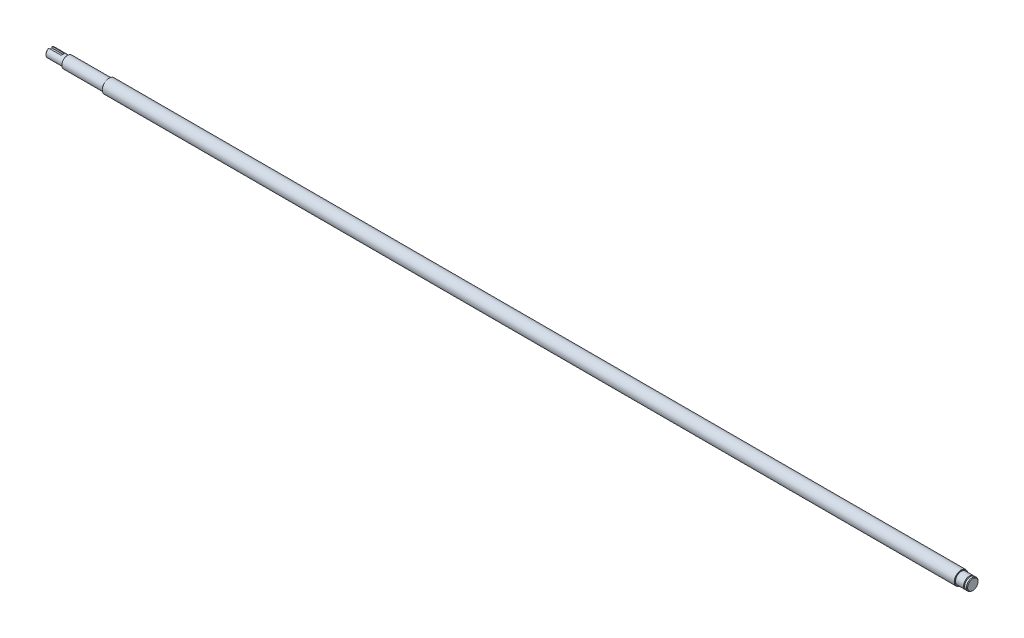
ISO-10303-21;
HEADER;
FILE_DESCRIPTION(('STEP AP214'),'2;1');
FILE_NAME('part.step','',(''),(''),'','','');
FILE_SCHEMA(('AUTOMOTIVE_DESIGN { 1 0 10303 214 1 1 1 1 }'));
ENDSEC;
DATA;
#1=APPLICATION_CONTEXT('core data for automotive mechanical design processes');
#2=APPLICATION_PROTOCOL_DEFINITION('international standard','automotive_design',2000,#1);
#3=PRODUCT_CONTEXT('',#1,'mechanical');
#4=PRODUCT('Part','Part','',(#3));
#5=PRODUCT_RELATED_PRODUCT_CATEGORY('part','',(#4));
#6=PRODUCT_DEFINITION_FORMATION('','',#4);
#7=PRODUCT_DEFINITION_CONTEXT('part definition',#1,'design');
#8=PRODUCT_DEFINITION('design','',#6,#7);
#9=PRODUCT_DEFINITION_SHAPE('','',#8);
#10=(LENGTH_UNIT() NAMED_UNIT(*) SI_UNIT(.MILLI.,.METRE.));
#11=(NAMED_UNIT(*) PLANE_ANGLE_UNIT() SI_UNIT($,.RADIAN.));
#12=(NAMED_UNIT(*) SI_UNIT($,.STERADIAN.) SOLID_ANGLE_UNIT());
#13=UNCERTAINTY_MEASURE_WITH_UNIT(LENGTH_MEASURE(1.E-05),#10,'distance_accuracy_value','');
#14=(GEOMETRIC_REPRESENTATION_CONTEXT(3) GLOBAL_UNCERTAINTY_ASSIGNED_CONTEXT((#13)) GLOBAL_UNIT_ASSIGNED_CONTEXT((#10,
#11,#12)) REPRESENTATION_CONTEXT('',''));
#15=CARTESIAN_POINT('',(0.,0.,0.));
#16=DIRECTION('',(0.,0.,1.));
#17=DIRECTION('',(1.,0.,0.));
#18=AXIS2_PLACEMENT_3D('',#15,#16,#17);
#19=CARTESIAN_POINT('',(0.,0.,0.));
#20=DIRECTION('',(1.,0.,0.));
#21=DIRECTION('',(0.,0.,-1.));
#22=AXIS2_PLACEMENT_3D('',#19,#20,#21);
#23=PLANE('',#22);
#24=DIRECTION('',(0.,0.,-1.));
#25=VECTOR('',#24,1.);
#26=CARTESIAN_POINT('',(1.70530256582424E-10,2.2,291593.51));
#27=LINE('',#26,#25);
#28=CARTESIAN_POINT('',(1.9197548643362E-12,2.2,1.50000000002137));
#29=VERTEX_POINT('',#28);
#30=CARTESIAN_POINT('',(1.9180201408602E-12,2.2,-1.50000000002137));
#31=VERTEX_POINT('',#30);
#32=EDGE_CURVE('E111',#29,#31,#27,.T.);
#33=ORIENTED_EDGE('',*,*,#32,.T.);
#34=DIRECTION('',(0.,-1.,0.));
#35=VECTOR('',#34,1.);
#36=CARTESIAN_POINT('',(1.9180201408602E-12,6.2,-1.50000000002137));
#37=LINE('',#36,#35);
#38=CARTESIAN_POINT('',(1.91802014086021E-12,3.16227766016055,-1.50000000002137));
#39=VERTEX_POINT('',#38);
#40=EDGE_CURVE('E123',#39,#31,#37,.T.);
#41=ORIENTED_EDGE('',*,*,#40,.F.);
#42=CARTESIAN_POINT('',(0.,0.,0.));
#43=DIRECTION('',(1.,0.,0.));
#44=DIRECTION('',(0.,0.,-1.));
#45=AXIS2_PLACEMENT_3D('',#42,#43,#44);
#46=CIRCLE('',#45,3.50000000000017);
#47=CARTESIAN_POINT('',(0.,3.16227766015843,1.50000000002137));
#48=VERTEX_POINT('',#47);
#49=EDGE_CURVE('E156',#39,#48,#46,.F.);
#50=ORIENTED_EDGE('',*,*,#49,.T.);
#51=DIRECTION('',(0.,-1.,0.));
#52=VECTOR('',#51,1.);
#53=CARTESIAN_POINT('',(1.9197548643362E-12,6.2,1.50000000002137));
#54=LINE('',#53,#52);
#55=EDGE_CURVE('E71',#48,#29,#54,.T.);
#56=ORIENTED_EDGE('',*,*,#55,.T.);
#57=EDGE_LOOP('',(#33,#41,#50,#56));
#58=FACE_BOUND('',#57,.T.);
#59=ADVANCED_FACE('F49',(#58),#23,.F.);
#60=CARTESIAN_POINT('',(0.,0.,0.));
#61=DIRECTION('',(-1.,0.,0.));
#62=DIRECTION('',(0.,0.,1.));
#63=AXIS2_PLACEMENT_3D('',#60,#61,#62);
#64=CYLINDRICAL_SURFACE('',#63,4.);
#65=CARTESIAN_POINT('',(0.499999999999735,0.,0.));
#66=DIRECTION('',(1.,0.,0.));
#67=DIRECTION('',(0.,0.,-1.));
#68=AXIS2_PLACEMENT_3D('',#65,#66,#67);
#69=CIRCLE('',#68,4.);
#70=CARTESIAN_POINT('',(0.499999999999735,3.70809924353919,1.50000000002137));
#71=VERTEX_POINT('',#70);
#72=CARTESIAN_POINT('',(0.499999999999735,3.70809924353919,-1.50000000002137));
#73=VERTEX_POINT('',#72);
#74=EDGE_CURVE('E159',#71,#73,#69,.T.);
#75=ORIENTED_EDGE('',*,*,#74,.T.);
#76=DIRECTION('',(-1.,0.,0.));
#77=VECTOR('',#76,1.);
#78=CARTESIAN_POINT('',(0.,3.70809924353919,-1.50000000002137));
#79=LINE('',#78,#77);
#80=CARTESIAN_POINT('',(9.99999999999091,3.70809924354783,-1.5));
#81=VERTEX_POINT('',#80);
#82=EDGE_CURVE('E79',#73,#81,#79,.F.);
#83=ORIENTED_EDGE('',*,*,#82,.T.);
#84=CARTESIAN_POINT('',(9.99999999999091,3.70809924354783,1.5));
#85=CARTESIAN_POINT('',(10.0405925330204,3.70809443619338,1.50000149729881));
#86=CARTESIAN_POINT('',(10.0811639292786,3.70876663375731,1.49835118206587));
#87=CARTESIAN_POINT('',(10.1619845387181,3.71141673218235,1.49177905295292));
#88=CARTESIAN_POINT('',(10.202233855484,3.7133941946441,1.48685833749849));
#89=CARTESIAN_POINT('',(10.321767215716,3.72118975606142,1.46729482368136));
#90=CARTESIAN_POINT('',(10.400199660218,3.72887188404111,1.44784998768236));
#91=CARTESIAN_POINT('',(10.5523675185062,3.74825217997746,1.39690233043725));
#92=CARTESIAN_POINT('',(10.626106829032,3.75994696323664,1.36540966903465));
#93=CARTESIAN_POINT('',(10.7673335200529,3.7860238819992,1.29134097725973));
#94=CARTESIAN_POINT('',(10.8348157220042,3.80040821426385,1.24875587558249));
#95=CARTESIAN_POINT('',(10.964891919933,3.83103589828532,1.1514660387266));
#96=CARTESIAN_POINT('',(11.0271300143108,3.84733374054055,1.09630269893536));
#97=CARTESIAN_POINT('',(11.1417235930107,3.87949782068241,0.976394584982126));
#98=CARTESIAN_POINT('',(11.194077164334,3.89536397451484,0.911647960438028));
#99=CARTESIAN_POINT('',(11.2891402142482,3.92552893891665,0.77169371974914));
#100=CARTESIAN_POINT('',(11.3314606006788,3.93975598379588,0.696204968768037));
#101=CARTESIAN_POINT('',(11.4026519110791,3.96438035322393,0.53855362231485));
#102=CARTESIAN_POINT('',(11.4315278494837,3.97477910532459,0.456393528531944));
#103=CARTESIAN_POINT('',(11.4737577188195,3.9901869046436,0.291490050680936));
#104=CARTESIAN_POINT('',(11.4877273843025,3.99540906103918,0.208924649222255));
#105=CARTESIAN_POINT('',(11.5017211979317,4.00064014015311,0.0424658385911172));
#106=CARTESIAN_POINT('',(11.5017496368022,4.00065066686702,-0.0414271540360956));
#107=CARTESIAN_POINT('',(11.4882181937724,3.99559264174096,-0.203744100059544));
#108=CARTESIAN_POINT('',(11.4753305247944,3.99077535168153,-0.282233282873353));
#109=CARTESIAN_POINT('',(11.4374637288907,3.97693262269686,-0.435840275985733));
#110=CARTESIAN_POINT('',(11.412483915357,3.96790694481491,-0.510957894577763));
#111=CARTESIAN_POINT('',(11.3508296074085,3.94637770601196,-0.656988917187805));
#112=CARTESIAN_POINT('',(11.3139901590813,3.93382542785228,-0.727825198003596));
#113=CARTESIAN_POINT('',(11.2298079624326,3.90651314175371,-0.862486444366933));
#114=CARTESIAN_POINT('',(11.1824617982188,3.89175241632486,-0.926309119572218));
#115=CARTESIAN_POINT('',(11.075376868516,3.86052643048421,-1.04908600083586));
#116=CARTESIAN_POINT('',(11.0150756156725,3.84401196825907,-1.10753779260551));
#117=CARTESIAN_POINT('',(10.8854158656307,3.81182684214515,-1.21369725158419));
#118=CARTESIAN_POINT('',(10.8160538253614,3.79615651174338,-1.26140069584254));
#119=CARTESIAN_POINT('',(10.6682419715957,3.767118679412,-1.34567998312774));
#120=CARTESIAN_POINT('',(10.5896215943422,3.75381153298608,-1.38197861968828));
#121=CARTESIAN_POINT('',(10.4267936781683,3.73171449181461,-1.44059114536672));
#122=CARTESIAN_POINT('',(10.3425957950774,3.72291700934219,-1.46292853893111));
#123=CARTESIAN_POINT('',(10.2146189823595,3.71406226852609,-1.48519272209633));
#124=CARTESIAN_POINT('',(10.1718976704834,3.71183476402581,-1.49074028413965));
#125=CARTESIAN_POINT('',(10.0861259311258,3.70885093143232,-1.49814308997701));
#126=CARTESIAN_POINT('',(10.0430758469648,3.70809323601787,-1.50000176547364));
#127=CARTESIAN_POINT('',(9.99999999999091,3.70809924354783,-1.5));
#128=B_SPLINE_CURVE_WITH_KNOTS('',3,(#84,#85,#86,#87,#88,#89,#90,#91,#92,#93,#94,#95,#96,#97,
#98,#99,#100,#101,#102,#103,#104,#105,#106,#107,#108,#109,#110,#111,#112,#113,#114,#115,#116,
#117,#118,#119,#120,#121,#122,#123,#124,#125,#126,#127),.UNSPECIFIED.,.F.,.F.,(4,2,2,2,2,2,2,2,
2,2,2,2,2,2,2,2,2,2,2,2,2,4),(0.,0.121697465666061,0.243354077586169,0.485593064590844,
0.727628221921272,0.969861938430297,1.22298027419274,1.47614754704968,1.73793539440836,
1.99962552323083,2.2500292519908,2.50035591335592,2.7382976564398,2.97625291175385,
3.21767225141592,3.4591701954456,3.71477993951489,3.97048993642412,4.23200510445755,
4.49307880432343,4.62233004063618,4.75146098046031),.UNSPECIFIED.);
#129=CARTESIAN_POINT('',(9.99999999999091,3.70809924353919,1.50000000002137));
#130=VERTEX_POINT('',#129);
#131=EDGE_CURVE('E11',#130,#81,#128,.T.);
#132=ORIENTED_EDGE('',*,*,#131,.F.);
#133=DIRECTION('',(-1.,0.,0.));
#134=VECTOR('',#133,1.);
#135=CARTESIAN_POINT('',(0.,3.70809924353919,1.50000000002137));
#136=LINE('',#135,#134);
#137=EDGE_CURVE('E129',#130,#71,#136,.T.);
#138=ORIENTED_EDGE('',*,*,#137,.T.);
#139=EDGE_LOOP('',(#75,#83,#132,#138));
#140=FACE_BOUND('',#139,.T.);
#141=CARTESIAN_POINT('',(15.,0.,0.));
#142=DIRECTION('',(-1.,0.,0.));
#143=DIRECTION('',(0.,0.,1.));
#144=AXIS2_PLACEMENT_3D('',#141,#142,#143);
#145=CIRCLE('',#144,4.);
#146=CARTESIAN_POINT('',(15.,0.,4.));
#147=VERTEX_POINT('',#146);
#148=EDGE_CURVE('E153',#147,#147,#145,.T.);
#149=ORIENTED_EDGE('',*,*,#148,.T.);
#150=EDGE_LOOP('',(#149));
#151=FACE_BOUND('',#150,.T.);
#152=ADVANCED_FACE('F254',(#140,#151),#64,.T.);
#153=CARTESIAN_POINT('',(15.,4.,0.));
#154=DIRECTION('',(1.,0.,0.));
#155=DIRECTION('',(0.,0.,-1.));
#156=AXIS2_PLACEMENT_3D('',#153,#154,#155);
#157=PLANE('',#156);
#158=CARTESIAN_POINT('',(15.,0.,0.));
#159=DIRECTION('',(1.,0.,0.));
#160=DIRECTION('',(0.,0.,-1.));
#161=AXIS2_PLACEMENT_3D('',#158,#159,#160);
#162=CIRCLE('',#161,4.79999999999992);
#163=CARTESIAN_POINT('',(15.,0.,-4.79999999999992));
#164=VERTEX_POINT('',#163);
#165=EDGE_CURVE('E180',#164,#164,#162,.F.);
#166=ORIENTED_EDGE('',*,*,#165,.T.);
#167=EDGE_LOOP('',(#166));
#168=FACE_BOUND('',#167,.T.);
#169=ORIENTED_EDGE('',*,*,#148,.F.);
#170=EDGE_LOOP('',(#169));
#171=FACE_BOUND('',#170,.T.);
#172=ADVANCED_FACE('F251',(#168,#171),#157,.F.);
#173=CARTESIAN_POINT('',(0.,0.,0.));
#174=DIRECTION('',(-1.,0.,0.));
#175=DIRECTION('',(0.,0.,1.));
#176=AXIS2_PLACEMENT_3D('',#173,#174,#175);
#177=CYLINDRICAL_SURFACE('',#176,5.);
#178=CARTESIAN_POINT('',(15.2,0.,0.));
#179=DIRECTION('',(1.,0.,0.));
#180=DIRECTION('',(0.,0.,-1.));
#181=AXIS2_PLACEMENT_3D('',#178,#179,#180);
#182=CIRCLE('',#181,5.);
#183=CARTESIAN_POINT('',(15.2,0.,-5.));
#184=VERTEX_POINT('',#183);
#185=EDGE_CURVE('E183',#184,#184,#182,.T.);
#186=ORIENTED_EDGE('',*,*,#185,.T.);
#187=EDGE_LOOP('',(#186));
#188=FACE_BOUND('',#187,.T.);
#189=CARTESIAN_POINT('',(51.,0.,0.));
#190=DIRECTION('',(-1.,0.,0.));
#191=DIRECTION('',(0.,0.,1.));
#192=AXIS2_PLACEMENT_3D('',#189,#190,#191);
#193=CIRCLE('',#192,5.);
#194=CARTESIAN_POINT('',(51.,0.,5.));
#195=VERTEX_POINT('',#194);
#196=EDGE_CURVE('E150',#195,#195,#193,.T.);
#197=ORIENTED_EDGE('',*,*,#196,.T.);
#198=EDGE_LOOP('',(#197));
#199=FACE_BOUND('',#198,.T.);
#200=ADVANCED_FACE('F247',(#188,#199),#177,.T.);
#201=CARTESIAN_POINT('',(51.,5.,0.));
#202=DIRECTION('',(1.,0.,0.));
#203=DIRECTION('',(0.,0.,-1.));
#204=AXIS2_PLACEMENT_3D('',#201,#202,#203);
#205=PLANE('',#204);
#206=CARTESIAN_POINT('',(51.,0.,0.));
#207=DIRECTION('',(1.,0.,0.));
#208=DIRECTION('',(0.,0.,-1.));
#209=AXIS2_PLACEMENT_3D('',#206,#207,#208);
#210=CIRCLE('',#209,5.70000000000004);
#211=CARTESIAN_POINT('',(51.,0.,-5.70000000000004));
#212=VERTEX_POINT('',#211);
#213=EDGE_CURVE('E168',#212,#212,#210,.F.);
#214=ORIENTED_EDGE('',*,*,#213,.T.);
#215=EDGE_LOOP('',(#214));
#216=FACE_BOUND('',#215,.T.);
#217=ORIENTED_EDGE('',*,*,#196,.F.);
#218=EDGE_LOOP('',(#217));
#219=FACE_BOUND('',#218,.T.);
#220=ADVANCED_FACE('F243',(#216,#219),#205,.F.);
#221=CARTESIAN_POINT('',(0.,0.,0.));
#222=DIRECTION('',(-1.,0.,0.));
#223=DIRECTION('',(0.,0.,1.));
#224=AXIS2_PLACEMENT_3D('',#221,#222,#223);
#225=CYLINDRICAL_SURFACE('',#224,5.9);
#226=CARTESIAN_POINT('',(51.2,0.,0.));
#227=DIRECTION('',(1.,0.,0.));
#228=DIRECTION('',(0.,0.,-1.));
#229=AXIS2_PLACEMENT_3D('',#226,#227,#228);
#230=CIRCLE('',#229,5.9);
#231=CARTESIAN_POINT('',(51.2,0.,-5.9));
#232=VERTEX_POINT('',#231);
#233=EDGE_CURVE('E174',#232,#232,#230,.T.);
#234=ORIENTED_EDGE('',*,*,#233,.T.);
#235=EDGE_LOOP('',(#234));
#236=FACE_BOUND('',#235,.T.);
#237=CARTESIAN_POINT('',(789.8,0.,0.));
#238=DIRECTION('',(-1.,0.,0.));
#239=DIRECTION('',(0.,0.,1.));
#240=AXIS2_PLACEMENT_3D('',#237,#238,#239);
#241=CIRCLE('',#240,5.9);
#242=CARTESIAN_POINT('',(789.8,0.,5.89999999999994));
#243=VERTEX_POINT('',#242);
#244=EDGE_CURVE('E171',#243,#243,#241,.T.);
#245=ORIENTED_EDGE('',*,*,#244,.T.);
#246=EDGE_LOOP('',(#245));
#247=FACE_BOUND('',#246,.T.);
#248=ADVANCED_FACE('F239',(#236,#247),#225,.T.);
#249=CARTESIAN_POINT('',(790.,5.9,0.));
#250=DIRECTION('',(-1.,0.,0.));
#251=DIRECTION('',(0.,0.,1.));
#252=AXIS2_PLACEMENT_3D('',#249,#250,#251);
#253=PLANE('',#252);
#254=CARTESIAN_POINT('',(790.,0.,0.));
#255=DIRECTION('',(-1.,0.,0.));
#256=DIRECTION('',(0.,0.,1.));
#257=AXIS2_PLACEMENT_3D('',#254,#255,#256);
#258=CIRCLE('',#257,5.70000000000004);
#259=CARTESIAN_POINT('',(790.,0.,5.69999999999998));
#260=VERTEX_POINT('',#259);
#261=EDGE_CURVE('E177',#260,#260,#258,.F.);
#262=ORIENTED_EDGE('',*,*,#261,.T.);
#263=EDGE_LOOP('',(#262));
#264=FACE_BOUND('',#263,.T.);
#265=CARTESIAN_POINT('',(790.,0.,0.));
#266=DIRECTION('',(-1.,0.,0.));
#267=DIRECTION('',(0.,0.,1.));
#268=AXIS2_PLACEMENT_3D('',#265,#266,#267);
#269=CIRCLE('',#268,5.);
#270=CARTESIAN_POINT('',(790.,0.,5.));
#271=VERTEX_POINT('',#270);
#272=EDGE_CURVE('E147',#271,#271,#269,.T.);
#273=ORIENTED_EDGE('',*,*,#272,.T.);
#274=EDGE_LOOP('',(#273));
#275=FACE_BOUND('',#274,.T.);
#276=ADVANCED_FACE('F235',(#264,#275),#253,.F.);
#277=CARTESIAN_POINT('',(0.,0.,0.));
#278=DIRECTION('',(-1.,0.,0.));
#279=DIRECTION('',(0.,0.,1.));
#280=AXIS2_PLACEMENT_3D('',#277,#278,#279);
#281=CYLINDRICAL_SURFACE('',#280,5.);
#282=ORIENTED_EDGE('',*,*,#272,.F.);
#283=EDGE_LOOP('',(#282));
#284=FACE_BOUND('',#283,.T.);
#285=CARTESIAN_POINT('',(797.,0.,0.));
#286=DIRECTION('',(-1.,0.,0.));
#287=DIRECTION('',(0.,0.,1.));
#288=AXIS2_PLACEMENT_3D('',#285,#286,#287);
#289=CIRCLE('',#288,5.);
#290=CARTESIAN_POINT('',(797.,0.,5.));
#291=VERTEX_POINT('',#290);
#292=EDGE_CURVE('E144',#291,#291,#289,.T.);
#293=ORIENTED_EDGE('',*,*,#292,.T.);
#294=EDGE_LOOP('',(#293));
#295=FACE_BOUND('',#294,.T.);
#296=ADVANCED_FACE('F231',(#284,#295),#281,.T.);
#297=CARTESIAN_POINT('',(797.,3.8,0.));
#298=DIRECTION('',(-1.,0.,0.));
#299=DIRECTION('',(0.,0.,1.));
#300=AXIS2_PLACEMENT_3D('',#297,#298,#299);
#301=PLANE('',#300);
#302=ORIENTED_EDGE('',*,*,#292,.F.);
#303=EDGE_LOOP('',(#302));
#304=FACE_BOUND('',#303,.T.);
#305=CARTESIAN_POINT('',(797.,0.,0.));
#306=DIRECTION('',(-1.,0.,0.));
#307=DIRECTION('',(0.,0.,1.));
#308=AXIS2_PLACEMENT_3D('',#305,#306,#307);
#309=CIRCLE('',#308,3.8);
#310=CARTESIAN_POINT('',(797.,0.,3.8));
#311=VERTEX_POINT('',#310);
#312=EDGE_CURVE('E141',#311,#311,#309,.T.);
#313=ORIENTED_EDGE('',*,*,#312,.T.);
#314=EDGE_LOOP('',(#313));
#315=FACE_BOUND('',#314,.T.);
#316=ADVANCED_FACE('F227',(#304,#315),#301,.F.);
#317=CARTESIAN_POINT('',(0.,0.,0.));
#318=DIRECTION('',(-1.,0.,0.));
#319=DIRECTION('',(0.,0.,1.));
#320=AXIS2_PLACEMENT_3D('',#317,#318,#319);
#321=CYLINDRICAL_SURFACE('',#320,3.8);
#322=ORIENTED_EDGE('',*,*,#312,.F.);
#323=EDGE_LOOP('',(#322));
#324=FACE_BOUND('',#323,.T.);
#325=CARTESIAN_POINT('',(797.9,0.,0.));
#326=DIRECTION('',(-1.,0.,0.));
#327=DIRECTION('',(0.,0.,1.));
#328=AXIS2_PLACEMENT_3D('',#325,#326,#327);
#329=CIRCLE('',#328,3.8);
#330=CARTESIAN_POINT('',(797.9,0.,3.8));
#331=VERTEX_POINT('',#330);
#332=EDGE_CURVE('E138',#331,#331,#329,.T.);
#333=ORIENTED_EDGE('',*,*,#332,.T.);
#334=EDGE_LOOP('',(#333));
#335=FACE_BOUND('',#334,.T.);
#336=ADVANCED_FACE('F223',(#324,#335),#321,.T.);
#337=CARTESIAN_POINT('',(797.9,5.,0.));
#338=DIRECTION('',(1.,0.,0.));
#339=DIRECTION('',(0.,0.,-1.));
#340=AXIS2_PLACEMENT_3D('',#337,#338,#339);
#341=PLANE('',#340);
#342=ORIENTED_EDGE('',*,*,#332,.F.);
#343=EDGE_LOOP('',(#342));
#344=FACE_BOUND('',#343,.T.);
#345=CARTESIAN_POINT('',(797.9,0.,0.));
#346=DIRECTION('',(-1.,0.,0.));
#347=DIRECTION('',(0.,0.,1.));
#348=AXIS2_PLACEMENT_3D('',#345,#346,#347);
#349=CIRCLE('',#348,5.);
#350=CARTESIAN_POINT('',(797.9,0.,5.));
#351=VERTEX_POINT('',#350);
#352=EDGE_CURVE('E135',#351,#351,#349,.T.);
#353=ORIENTED_EDGE('',*,*,#352,.T.);
#354=EDGE_LOOP('',(#353));
#355=FACE_BOUND('',#354,.T.);
#356=ADVANCED_FACE('F219',(#344,#355),#341,.F.);
#357=CARTESIAN_POINT('',(0.,0.,0.));
#358=DIRECTION('',(-1.,0.,0.));
#359=DIRECTION('',(0.,0.,1.));
#360=AXIS2_PLACEMENT_3D('',#357,#358,#359);
#361=CYLINDRICAL_SURFACE('',#360,5.);
#362=CARTESIAN_POINT('',(799.5,0.,0.));
#363=DIRECTION('',(-1.,0.,0.));
#364=DIRECTION('',(0.,0.,1.));
#365=AXIS2_PLACEMENT_3D('',#362,#363,#364);
#366=CIRCLE('',#365,5.);
#367=CARTESIAN_POINT('',(799.5,0.,5.));
#368=VERTEX_POINT('',#367);
#369=EDGE_CURVE('E162',#368,#368,#366,.T.);
#370=ORIENTED_EDGE('',*,*,#369,.T.);
#371=EDGE_LOOP('',(#370));
#372=FACE_BOUND('',#371,.T.);
#373=ORIENTED_EDGE('',*,*,#352,.F.);
#374=EDGE_LOOP('',(#373));
#375=FACE_BOUND('',#374,.T.);
#376=ADVANCED_FACE('F215',(#372,#375),#361,.T.);
#377=CARTESIAN_POINT('',(800.,0.,0.));
#378=DIRECTION('',(-1.,0.,0.));
#379=DIRECTION('',(0.,0.,1.));
#380=AXIS2_PLACEMENT_3D('',#377,#378,#379);
#381=PLANE('',#380);
#382=CARTESIAN_POINT('',(800.,0.,0.));
#383=DIRECTION('',(-1.,0.,0.));
#384=DIRECTION('',(0.,0.,1.));
#385=AXIS2_PLACEMENT_3D('',#382,#383,#384);
#386=CIRCLE('',#385,4.49999999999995);
#387=CARTESIAN_POINT('',(800.,0.,4.49999999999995));
#388=VERTEX_POINT('',#387);
#389=EDGE_CURVE('E165',#388,#388,#386,.F.);
#390=ORIENTED_EDGE('',*,*,#389,.T.);
#391=EDGE_LOOP('',(#390));
#392=FACE_BOUND('',#391,.T.);
#393=ADVANCED_FACE('F212',(#392),#381,.F.);
#394=CARTESIAN_POINT('',(0.,0.,0.));
#395=DIRECTION('',(1.,0.,0.));
#396=DIRECTION('',(0.,0.,-1.));
#397=AXIS2_PLACEMENT_3D('',#394,#395,#396);
#398=CONICAL_SURFACE('',#397,3.50000000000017,0.785398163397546);
#399=CARTESIAN_POINT('',(2.36835416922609,5.67340996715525,-1.50000000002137));
#400=CARTESIAN_POINT('',(2.17756319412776,5.47601224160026,-1.50000000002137));
#401=CARTESIAN_POINT('',(1.98705897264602,5.27833368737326,-1.50000000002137));
#402=CARTESIAN_POINT('',(1.6071273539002,4.88221667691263,-1.50000000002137));
#403=CARTESIAN_POINT('',(1.41769928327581,4.68377886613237,-1.50000000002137));
#404=CARTESIAN_POINT('',(1.04077733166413,4.28632593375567,-1.50000000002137));
#405=CARTESIAN_POINT('',(0.853279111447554,4.08731493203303,-1.50000000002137));
#406=CARTESIAN_POINT('',(0.48009169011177,3.68732776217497,-1.50000000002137));
#407=CARTESIAN_POINT('',(0.294403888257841,3.48635028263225,-1.50000000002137));
#408=CARTESIAN_POINT('',(0.0177020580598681,3.18213552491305,-1.50000000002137));
#409=CARTESIAN_POINT('',(-0.0744916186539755,3.07997217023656,-1.50000000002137));
#410=CARTESIAN_POINT('',(-0.257807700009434,2.87470938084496,-1.50000000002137));
#411=CARTESIAN_POINT('',(-0.348930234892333,2.77161006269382,-1.50000000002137));
#412=CARTESIAN_POINT('',(-0.529586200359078,2.56435854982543,-1.50000000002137));
#413=CARTESIAN_POINT('',(-0.619122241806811,2.46020863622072,-1.50000000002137));
#414=CARTESIAN_POINT('',(-0.796267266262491,2.25019202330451,-1.50000000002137));
#415=CARTESIAN_POINT('',(-0.883875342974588,2.14432455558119,-1.50000000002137));
#416=CARTESIAN_POINT('',(-1.05677433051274,1.92962021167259,-1.50000000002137));
#417=CARTESIAN_POINT('',(-1.14204749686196,1.82076898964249,-1.50000000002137));
#418=CARTESIAN_POINT('',(-1.30813702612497,1.59987725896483,-1.50000000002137));
#419=CARTESIAN_POINT('',(-1.38895894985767,1.48784100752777,-1.50000000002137));
#420=CARTESIAN_POINT('',(-1.50513269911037,1.31577989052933,-1.50000000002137));
#421=CARTESIAN_POINT('',(-1.54313542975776,1.2575520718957,-1.50000000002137));
#422=CARTESIAN_POINT('',(-1.61674675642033,1.13963478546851,-1.50000000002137));
#423=CARTESIAN_POINT('',(-1.65235653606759,1.07994606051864,-1.50000000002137));
#424=CARTESIAN_POINT('',(-1.72061424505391,0.958519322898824,-1.50000000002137));
#425=CARTESIAN_POINT('',(-1.75324836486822,0.896773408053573,-1.50000000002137));
#426=CARTESIAN_POINT('',(-1.81428618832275,0.771105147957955,-1.50000000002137));
#427=CARTESIAN_POINT('',(-1.84268236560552,0.707179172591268,-1.50000000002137));
#428=CARTESIAN_POINT('',(-1.8683541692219,0.642081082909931,-1.50000000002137));
#429=B_SPLINE_CURVE_WITH_KNOTS('',3,(#399,#400,#401,#402,#403,#404,#405,#406,#407,#408,#409,
#410,#411,#412,#413,#414,#415,#416,#417,#418,#419,#420,#421,#422,#423,#424,#425,#426,#427,#428),
.UNSPECIFIED.,.F.,.F.,(4,2,2,2,2,2,2,2,2,2,2,2,2,2,4),(0.,0.823595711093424,1.64660170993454,
2.46686841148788,3.28772553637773,3.70055587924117,4.11333549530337,4.52535710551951,
4.9375684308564,5.35233672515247,5.76657452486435,5.97512653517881,6.18357461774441,
6.39294546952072,6.60268383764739),.UNSPECIFIED.);
#430=EDGE_CURVE('E64',#73,#39,#429,.T.);
#431=ORIENTED_EDGE('',*,*,#430,.F.);
#432=ORIENTED_EDGE('',*,*,#74,.F.);
#433=CARTESIAN_POINT('',(-1.86835416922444,0.642081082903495,1.50000000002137));
#434=CARTESIAN_POINT('',(-1.84730576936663,0.695507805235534,1.50000000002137));
#435=CARTESIAN_POINT('',(-1.82439468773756,0.748151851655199,1.50000000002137));
#436=CARTESIAN_POINT('',(-1.77555646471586,0.851951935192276,1.50000000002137));
#437=CARTESIAN_POINT('',(-1.74963298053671,0.903109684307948,1.50000000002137));
#438=CARTESIAN_POINT('',(-1.69553740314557,1.00393349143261,1.50000000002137));
#439=CARTESIAN_POINT('',(-1.66737504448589,1.05360483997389,1.50000000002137));
#440=CARTESIAN_POINT('',(-1.60917829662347,1.15185543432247,1.50000000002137));
#441=CARTESIAN_POINT('',(-1.57914326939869,1.20043430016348,1.50000000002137));
#442=CARTESIAN_POINT('',(-1.48711344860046,1.34430709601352,1.50000000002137));
#443=CARTESIAN_POINT('',(-1.42293448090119,1.43820323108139,1.50000000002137));
#444=CARTESIAN_POINT('',(-1.32376996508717,1.57702551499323,1.50000000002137));
#445=CARTESIAN_POINT('',(-1.29020874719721,1.62299305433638,1.50000000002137));
#446=CARTESIAN_POINT('',(-1.22228120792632,1.71433318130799,1.50000000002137));
#447=CARTESIAN_POINT('',(-1.18791487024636,1.75970575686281,1.50000000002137));
#448=CARTESIAN_POINT('',(-1.08726811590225,1.89057910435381,1.50000000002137));
#449=CARTESIAN_POINT('',(-1.0201230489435,1.97541393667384,1.50000000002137));
#450=CARTESIAN_POINT('',(-0.884097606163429,2.14368391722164,1.50000000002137));
#451=CARTESIAN_POINT('',(-0.815217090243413,2.22711895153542,1.50000000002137));
#452=CARTESIAN_POINT('',(-0.606626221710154,2.4758537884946,1.50000000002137));
#453=CARTESIAN_POINT('',(-0.464998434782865,2.63954282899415,1.50000000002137));
#454=CARTESIAN_POINT('',(-0.178654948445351,2.96430783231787,1.50000000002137));
#455=CARTESIAN_POINT('',(-0.0339378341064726,3.12538253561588,1.50000000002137));
#456=CARTESIAN_POINT('',(0.257453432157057,3.44570394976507,1.50000000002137));
#457=CARTESIAN_POINT('',(0.404127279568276,3.6049509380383,1.50000000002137));
#458=CARTESIAN_POINT('',(0.701128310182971,3.92466848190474,1.50000000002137));
#459=CARTESIAN_POINT('',(0.851476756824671,4.08511923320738,1.50000000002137));
#460=CARTESIAN_POINT('',(1.15317264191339,4.40509341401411,1.50000000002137));
#461=CARTESIAN_POINT('',(1.30452013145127,4.56461679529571,1.50000000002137));
#462=CARTESIAN_POINT('',(1.6076427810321,4.88265654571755,1.50000000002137));
#463=CARTESIAN_POINT('',(1.75941651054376,5.04117427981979,1.50000000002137));
#464=CARTESIAN_POINT('',(2.06351252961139,5.35766185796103,1.50000000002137));
#465=CARTESIAN_POINT('',(2.2158347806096,5.51563173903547,1.50000000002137));
#466=CARTESIAN_POINT('',(2.36835416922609,5.67340996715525,1.50000000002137));
#467=B_SPLINE_CURVE_WITH_KNOTS('',3,(#433,#434,#435,#436,#437,#438,#439,#440,#441,#442,#443,
#444,#445,#446,#447,#448,#449,#450,#451,#452,#453,#454,#455,#456,#457,#458,#459,#460,#461,#462,
#463,#464,#465,#466),.UNSPECIFIED.,.F.,.F.,(4,2,2,2,2,2,2,2,2,2,2,2,2,2,2,2,4),(0.,
0.172169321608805,0.344131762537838,0.515383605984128,0.686694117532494,1.02771817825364,
1.19846153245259,1.36920834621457,1.6937485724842,2.0183150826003,2.66760265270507,
3.31719426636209,3.9666859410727,4.62633351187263,5.28601508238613,5.94439665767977,
6.60273282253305),.UNSPECIFIED.);
#468=EDGE_CURVE('E186',#48,#71,#467,.T.);
#469=ORIENTED_EDGE('',*,*,#468,.F.);
#470=ORIENTED_EDGE('',*,*,#49,.F.);
#471=EDGE_LOOP('',(#431,#432,#469,#470));
#472=FACE_BOUND('',#471,.T.);
#473=ADVANCED_FACE('F199',(#472),#398,.T.);
#474=CARTESIAN_POINT('',(799.5,0.,0.));
#475=DIRECTION('',(-1.,0.,0.));
#476=DIRECTION('',(0.,0.,1.));
#477=AXIS2_PLACEMENT_3D('',#474,#475,#476);
#478=CONICAL_SURFACE('',#477,5.,0.785398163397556);
#479=ORIENTED_EDGE('',*,*,#389,.F.);
#480=EDGE_LOOP('',(#479));
#481=FACE_BOUND('',#480,.T.);
#482=ORIENTED_EDGE('',*,*,#369,.F.);
#483=EDGE_LOOP('',(#482));
#484=FACE_BOUND('',#483,.T.);
#485=ADVANCED_FACE('F271',(#481,#484),#478,.T.);
#486=CARTESIAN_POINT('',(51.,0.,0.));
#487=DIRECTION('',(1.,0.,0.));
#488=DIRECTION('',(0.,0.,-1.));
#489=AXIS2_PLACEMENT_3D('',#486,#487,#488);
#490=CONICAL_SURFACE('',#489,5.70000000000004,0.785398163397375);
#491=ORIENTED_EDGE('',*,*,#233,.F.);
#492=EDGE_LOOP('',(#491));
#493=FACE_BOUND('',#492,.T.);
#494=ORIENTED_EDGE('',*,*,#213,.F.);
#495=EDGE_LOOP('',(#494));
#496=FACE_BOUND('',#495,.T.);
#497=ADVANCED_FACE('F275',(#493,#496),#490,.T.);
#498=CARTESIAN_POINT('',(789.8,0.,0.));
#499=DIRECTION('',(-1.,0.,0.));
#500=DIRECTION('',(0.,0.,1.));
#501=AXIS2_PLACEMENT_3D('',#498,#499,#500);
#502=CONICAL_SURFACE('',#501,5.9,0.785398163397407);
#503=CARTESIAN_POINT('',(790.,0.,5.69999999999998));
#504=CARTESIAN_POINT('',(789.997916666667,0.,5.70208333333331));
#505=CARTESIAN_POINT('',(789.995833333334,0.,5.70416666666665));
#506=CARTESIAN_POINT('',(789.991666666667,0.,5.70833333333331));
#507=CARTESIAN_POINT('',(789.989583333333,0.,5.71041666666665));
#508=CARTESIAN_POINT('',(789.985416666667,0.,5.71458333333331));
#509=CARTESIAN_POINT('',(789.983333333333,0.,5.71666666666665));
#510=CARTESIAN_POINT('',(789.979166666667,0.,5.72083333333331));
#511=CARTESIAN_POINT('',(789.977083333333,0.,5.72291666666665));
#512=CARTESIAN_POINT('',(789.972916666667,0.,5.72708333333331));
#513=CARTESIAN_POINT('',(789.970833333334,0.,5.72916666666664));
#514=CARTESIAN_POINT('',(789.966666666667,0.,5.73333333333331));
#515=CARTESIAN_POINT('',(789.964583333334,0.,5.73541666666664));
#516=CARTESIAN_POINT('',(789.960416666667,0.,5.73958333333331));
#517=CARTESIAN_POINT('',(789.958333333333,0.,5.74166666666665));
#518=CARTESIAN_POINT('',(789.954166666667,0.,5.74583333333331));
#519=CARTESIAN_POINT('',(789.952083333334,0.,5.74791666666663));
#520=CARTESIAN_POINT('',(789.947916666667,0.,5.75208333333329));
#521=CARTESIAN_POINT('',(789.945833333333,0.,5.75416666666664));
#522=CARTESIAN_POINT('',(789.941666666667,0.,5.75833333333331));
#523=CARTESIAN_POINT('',(789.939583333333,0.,5.76041666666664));
#524=CARTESIAN_POINT('',(789.935416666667,0.,5.7645833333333));
#525=CARTESIAN_POINT('',(789.933333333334,0.,5.76666666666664));
#526=CARTESIAN_POINT('',(789.929166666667,0.,5.7708333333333));
#527=CARTESIAN_POINT('',(789.927083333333,0.,5.77291666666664));
#528=CARTESIAN_POINT('',(789.922916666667,0.,5.7770833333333));
#529=CARTESIAN_POINT('',(789.920833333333,0.,5.77916666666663));
#530=CARTESIAN_POINT('',(789.916666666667,0.,5.7833333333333));
#531=CARTESIAN_POINT('',(789.914583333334,0.,5.78541666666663));
#532=CARTESIAN_POINT('',(789.910416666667,0.,5.7895833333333));
#533=CARTESIAN_POINT('',(789.908333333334,0.,5.79166666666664));
#534=CARTESIAN_POINT('',(789.904166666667,0.,5.7958333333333));
#535=CARTESIAN_POINT('',(789.902083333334,0.,5.79791666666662));
#536=CARTESIAN_POINT('',(789.897916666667,0.,5.80208333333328));
#537=CARTESIAN_POINT('',(789.895833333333,0.,5.80416666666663));
#538=CARTESIAN_POINT('',(789.891666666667,0.,5.8083333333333));
#539=CARTESIAN_POINT('',(789.889583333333,0.,5.81041666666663));
#540=CARTESIAN_POINT('',(789.885416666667,0.,5.81458333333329));
#541=CARTESIAN_POINT('',(789.883333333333,0.,5.81666666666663));
#542=CARTESIAN_POINT('',(789.879166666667,0.,5.82083333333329));
#543=CARTESIAN_POINT('',(789.877083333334,0.,5.82291666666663));
#544=CARTESIAN_POINT('',(789.872916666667,0.,5.82708333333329));
#545=CARTESIAN_POINT('',(789.870833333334,0.,5.82916666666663));
#546=CARTESIAN_POINT('',(789.866666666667,0.,5.83333333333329));
#547=CARTESIAN_POINT('',(789.864583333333,0.,5.83541666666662));
#548=CARTESIAN_POINT('',(789.860416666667,0.,5.83958333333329));
#549=CARTESIAN_POINT('',(789.858333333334,0.,5.84166666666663));
#550=CARTESIAN_POINT('',(789.854166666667,0.,5.8458333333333));
#551=CARTESIAN_POINT('',(789.852083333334,0.,5.84791666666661));
#552=CARTESIAN_POINT('',(789.847916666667,0.,5.85208333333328));
#553=CARTESIAN_POINT('',(789.845833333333,0.,5.85416666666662));
#554=CARTESIAN_POINT('',(789.841666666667,0.,5.85833333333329));
#555=CARTESIAN_POINT('',(789.839583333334,0.,5.86041666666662));
#556=CARTESIAN_POINT('',(789.835416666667,0.,5.86458333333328));
#557=CARTESIAN_POINT('',(789.833333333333,0.,5.86666666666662));
#558=CARTESIAN_POINT('',(789.829166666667,0.,5.87083333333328));
#559=CARTESIAN_POINT('',(789.827083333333,0.,5.87291666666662));
#560=CARTESIAN_POINT('',(789.822916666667,0.,5.87708333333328));
#561=CARTESIAN_POINT('',(789.820833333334,0.,5.87916666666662));
#562=CARTESIAN_POINT('',(789.816666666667,0.,5.88333333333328));
#563=CARTESIAN_POINT('',(789.814583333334,0.,5.88541666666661));
#564=CARTESIAN_POINT('',(789.810416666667,0.,5.88958333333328));
#565=CARTESIAN_POINT('',(789.808333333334,0.,5.89166666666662));
#566=CARTESIAN_POINT('',(789.804166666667,0.,5.89583333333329));
#567=CARTESIAN_POINT('',(789.802083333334,0.,5.89791666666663));
#568=CARTESIAN_POINT('',(789.8,0.,5.89999999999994));
#569=B_SPLINE_CURVE_WITH_KNOTS('',3,(#503,#504,#505,#506,#507,#508,#509,#510,#511,#512,#513,
#514,#515,#516,#517,#518,#519,#520,#521,#522,#523,#524,#525,#526,#527,#528,#529,#530,#531,#532,
#533,#534,#535,#536,#537,#538,#539,#540,#541,#542,#543,#544,#545,#546,#547,#548,#549,#550,#551,
#552,#553,#554,#555,#556,#557,#558,#559,#560,#561,#562,#563,#564,#565,#566,#567,#568),
.UNSPECIFIED.,.F.,.F.,(4,2,2,2,2,2,2,2,2,2,2,2,2,2,2,2,2,2,2,2,2,2,2,2,2,2,2,2,2,2,2,2,4),(0.,
0.00883883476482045,0.0176776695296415,0.0265165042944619,0.035355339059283,0.0441941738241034,
0.0530330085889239,0.0618718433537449,0.0707106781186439,0.079549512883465,0.0883883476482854,
0.0972271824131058,0.106066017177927,0.114904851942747,0.123743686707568,0.132582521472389,
0.141421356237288,0.150260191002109,0.159099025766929,0.16793786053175,0.176776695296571,
0.185615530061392,0.194454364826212,0.203293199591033,0.212132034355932,0.220970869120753,
0.229809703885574,0.238648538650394,0.247487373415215,0.256326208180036,0.265165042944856,
0.274003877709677,0.282842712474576),.UNSPECIFIED.);
#570=EDGE_CURVE('BSEAM280',#260,#243,#569,.T.);
#571=ORIENTED_EDGE('',*,*,#261,.F.);
#572=ORIENTED_EDGE('',*,*,#244,.F.);
#573=ORIENTED_EDGE('',*,*,#570,.T.);
#574=ORIENTED_EDGE('',*,*,#570,.F.);
#575=EDGE_LOOP('',(#571,#573,#572,#574));
#576=FACE_BOUND('',#575,.T.);
#577=ADVANCED_FACE('F280',(#576),#502,.T.);
#578=CARTESIAN_POINT('',(15.,0.,0.));
#579=DIRECTION('',(1.,0.,0.));
#580=DIRECTION('',(0.,0.,-1.));
#581=AXIS2_PLACEMENT_3D('',#578,#579,#580);
#582=CONICAL_SURFACE('',#581,4.79999999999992,0.785398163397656);
#583=ORIENTED_EDGE('',*,*,#185,.F.);
#584=EDGE_LOOP('',(#583));
#585=FACE_BOUND('',#584,.T.);
#586=ORIENTED_EDGE('',*,*,#165,.F.);
#587=EDGE_LOOP('',(#586));
#588=FACE_BOUND('',#587,.T.);
#589=ADVANCED_FACE('F52',(#585,#588),#582,.T.);
#590=CARTESIAN_POINT('',(10.,6.2,0.));
#591=DIRECTION('',(0.,-1.,0.));
#592=DIRECTION('',(0.,0.,-1.));
#593=AXIS2_PLACEMENT_3D('',#590,#591,#592);
#594=CYLINDRICAL_SURFACE('',#593,1.5);
#595=ORIENTED_EDGE('',*,*,#131,.T.);
#596=DIRECTION('',(0.,-1.,0.));
#597=VECTOR('',#596,1.);
#598=CARTESIAN_POINT('',(9.99999999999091,6.2,-1.5));
#599=LINE('',#598,#597);
#600=CARTESIAN_POINT('',(9.99999999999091,2.2,-1.5));
#601=VERTEX_POINT('',#600);
#602=EDGE_CURVE('E102',#81,#601,#599,.T.);
#603=ORIENTED_EDGE('',*,*,#602,.T.);
#604=CARTESIAN_POINT('',(10.,2.2,0.));
#605=DIRECTION('',(0.,1.,0.));
#606=DIRECTION('',(0.,0.,1.));
#607=AXIS2_PLACEMENT_3D('',#604,#605,#606);
#608=CIRCLE('',#607,1.5);
#609=CARTESIAN_POINT('',(9.99999999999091,2.2,1.50000000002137));
#610=VERTEX_POINT('',#609);
#611=EDGE_CURVE('E106',#610,#601,#608,.T.);
#612=ORIENTED_EDGE('',*,*,#611,.F.);
#613=DIRECTION('',(0.,-1.,0.));
#614=VECTOR('',#613,1.);
#615=CARTESIAN_POINT('',(9.99999999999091,6.2,1.50000000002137));
#616=LINE('',#615,#614);
#617=EDGE_CURVE('E110',#130,#610,#616,.T.);
#618=ORIENTED_EDGE('',*,*,#617,.F.);
#619=EDGE_LOOP('',(#595,#603,#612,#618));
#620=FACE_BOUND('',#619,.T.);
#621=ADVANCED_FACE('F104',(#620),#594,.F.);
#622=CARTESIAN_POINT('',(-399600.,6.2,-1.50000000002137));
#623=DIRECTION('',(0.,0.,-1.));
#624=DIRECTION('',(-1.,0.,0.));
#625=AXIS2_PLACEMENT_3D('',#622,#623,#624);
#626=PLANE('',#625);
#627=ORIENTED_EDGE('',*,*,#430,.T.);
#628=ORIENTED_EDGE('',*,*,#40,.T.);
#629=DIRECTION('',(1.,0.,0.));
#630=VECTOR('',#629,1.);
#631=CARTESIAN_POINT('',(-399600.,2.2,-1.50000000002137));
#632=LINE('',#631,#630);
#633=EDGE_CURVE('E117',#31,#601,#632,.T.);
#634=ORIENTED_EDGE('',*,*,#633,.T.);
#635=ORIENTED_EDGE('',*,*,#602,.F.);
#636=ORIENTED_EDGE('',*,*,#82,.F.);
#637=EDGE_LOOP('',(#627,#628,#634,#635,#636));
#638=FACE_BOUND('',#637,.T.);
#639=ADVANCED_FACE('F121',(#638),#626,.F.);
#640=CARTESIAN_POINT('',(-399600.,6.2,1.50000000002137));
#641=DIRECTION('',(0.,0.,1.));
#642=DIRECTION('',(1.,0.,0.));
#643=AXIS2_PLACEMENT_3D('',#640,#641,#642);
#644=PLANE('',#643);
#645=ORIENTED_EDGE('',*,*,#617,.T.);
#646=DIRECTION('',(-1.,0.,0.));
#647=VECTOR('',#646,1.);
#648=CARTESIAN_POINT('',(-399600.,2.2,1.50000000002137));
#649=LINE('',#648,#647);
#650=EDGE_CURVE('E119',#610,#29,#649,.T.);
#651=ORIENTED_EDGE('',*,*,#650,.T.);
#652=ORIENTED_EDGE('',*,*,#55,.F.);
#653=ORIENTED_EDGE('',*,*,#468,.T.);
#654=ORIENTED_EDGE('',*,*,#137,.F.);
#655=EDGE_LOOP('',(#645,#651,#652,#653,#654));
#656=FACE_BOUND('',#655,.T.);
#657=ADVANCED_FACE('F203',(#656),#644,.F.);
#658=CARTESIAN_POINT('',(10.,2.2,0.));
#659=DIRECTION('',(0.,1.,0.));
#660=DIRECTION('',(0.,0.,1.));
#661=AXIS2_PLACEMENT_3D('',#658,#659,#660);
#662=PLANE('',#661);
#663=ORIENTED_EDGE('',*,*,#633,.F.);
#664=ORIENTED_EDGE('',*,*,#32,.F.);
#665=ORIENTED_EDGE('',*,*,#650,.F.);
#666=ORIENTED_EDGE('',*,*,#611,.T.);
#667=EDGE_LOOP('',(#663,#664,#665,#666));
#668=FACE_BOUND('',#667,.T.);
#669=ADVANCED_FACE('F115',(#668),#662,.T.);
#670=CLOSED_SHELL('',(#59,#152,#172,#200,#220,#248,#276,#296,#316,#336,#356,#376,#393,#473,#485,
#497,#577,#589,#621,#639,#657,#669));
#671=MANIFOLD_SOLID_BREP('B2',#670);
#672=ADVANCED_BREP_SHAPE_REPRESENTATION('',(#18,#671),#14);
#673=SHAPE_DEFINITION_REPRESENTATION(#9,#672);
ENDSEC;
END-ISO-10303-21;
